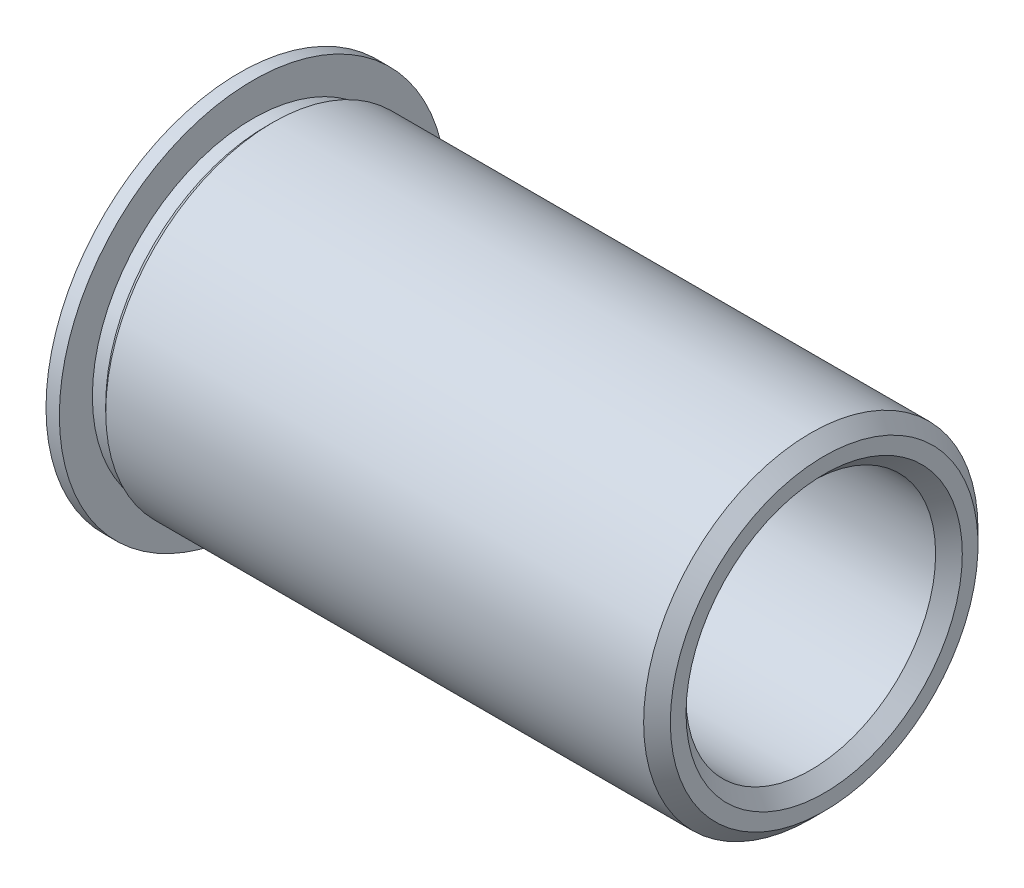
from build123d import *

# Parameters (mm, degrees)
SKETCH3_R          = 2.3749
CUT_EXTRUDE1_DEPTH = 100.813431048
CHAMFER2_SIZE      = 0.254
CHAMFER3_SIZE      = 0.254


with BuildPart() as part:
    # Sketch2 → Revolve3 (revolve)
    with BuildSketch(Plane.XY, mode=Mode.PRIVATE) as revolve3_sk:
        Polygon((-56.216282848, 95.440087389), (-56.216282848, 99.123087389), (-55.962282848, 99.123087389), (-55.962282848, 98.494437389), (-55.708282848, 98.494437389), (-55.581282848, 98.621437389), (-45.345082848, 98.621437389), (-45.091082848, 98.367437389), (-45.091082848, 95.440087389), align=None)
    revolve(revolve3_sk.sketch.rotate(Axis((-56.216282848, 95.440087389, 0), (1, 0, 0)), 90), axis=Axis((-56.216282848, 95.440087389, 0), (1, 0, 0)))

    # Sketch3 → Cut-Extrude1 (cut, through all)
    with BuildSketch(Plane(origin=(-45.091082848, 0, 0), x_dir=(0, 0, -1), z_dir=(1, 0, 0))):
        with Locations((0, 95.440087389)):
            Circle(SKETCH3_R)
    extrude(amount=-CUT_EXTRUDE1_DEPTH, mode=Mode.SUBTRACT)

    # Chamfer2
    chamfer2_edges = [part.edges().sort_by_distance(p)[0] for p in [
        (-56.216282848, 95.440087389, 2.3749),
    ]]
    chamfer(chamfer2_edges, length=CHAMFER2_SIZE)

    # Chamfer3
    chamfer3_edges = [part.edges().sort_by_distance(p)[0] for p in [
        (-45.091082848, 95.440087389, 2.3749),
    ]]
    chamfer(chamfer3_edges, length=CHAMFER3_SIZE)


solid = part.part
